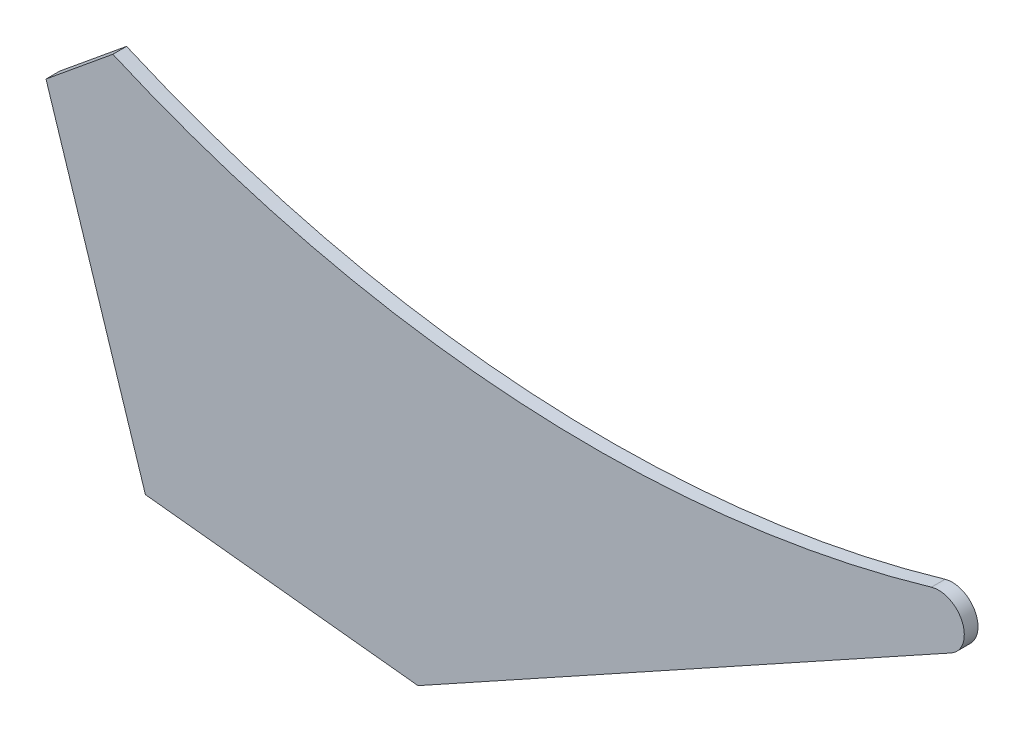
ISO-10303-21;
HEADER;
FILE_DESCRIPTION(('STEP AP214'),'2;1');
FILE_NAME('part.step','',(''),(''),'','','');
FILE_SCHEMA(('AUTOMOTIVE_DESIGN { 1 0 10303 214 1 1 1 1 }'));
ENDSEC;
DATA;
#1=APPLICATION_CONTEXT('core data for automotive mechanical design processes');
#2=APPLICATION_PROTOCOL_DEFINITION('international standard','automotive_design',2000,#1);
#3=PRODUCT_CONTEXT('',#1,'mechanical');
#4=PRODUCT('Part','Part','',(#3));
#5=PRODUCT_RELATED_PRODUCT_CATEGORY('part','',(#4));
#6=PRODUCT_DEFINITION_FORMATION('','',#4);
#7=PRODUCT_DEFINITION_CONTEXT('part definition',#1,'design');
#8=PRODUCT_DEFINITION('design','',#6,#7);
#9=PRODUCT_DEFINITION_SHAPE('','',#8);
#10=(LENGTH_UNIT() NAMED_UNIT(*) SI_UNIT(.MILLI.,.METRE.));
#11=(NAMED_UNIT(*) PLANE_ANGLE_UNIT() SI_UNIT($,.RADIAN.));
#12=(NAMED_UNIT(*) SI_UNIT($,.STERADIAN.) SOLID_ANGLE_UNIT());
#13=UNCERTAINTY_MEASURE_WITH_UNIT(LENGTH_MEASURE(1.E-05),#10,'distance_accuracy_value','');
#14=(GEOMETRIC_REPRESENTATION_CONTEXT(3) GLOBAL_UNCERTAINTY_ASSIGNED_CONTEXT((#13)) GLOBAL_UNIT_ASSIGNED_CONTEXT((#10,
#11,#12)) REPRESENTATION_CONTEXT('',''));
#15=CARTESIAN_POINT('',(0.,0.,0.));
#16=DIRECTION('',(0.,0.,1.));
#17=DIRECTION('',(1.,0.,0.));
#18=AXIS2_PLACEMENT_3D('',#15,#16,#17);
#19=CARTESIAN_POINT('',(0.,0.,8.));
#20=DIRECTION('',(-0.483969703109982,0.875084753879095,0.));
#21=DIRECTION('',(-0.875084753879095,-0.483969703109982,0.));
#22=AXIS2_PLACEMENT_3D('',#19,#20,#21);
#23=PLANE('',#22);
#24=DIRECTION('',(0.875084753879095,0.483969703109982,0.));
#25=VECTOR('',#24,1.);
#26=CARTESIAN_POINT('',(0.,0.,0.));
#27=LINE('',#26,#25);
#28=CARTESIAN_POINT('',(0.,0.,0.));
#29=VERTEX_POINT('',#28);
#30=CARTESIAN_POINT('',(311.,172.,0.));
#31=VERTEX_POINT('',#30);
#32=EDGE_CURVE('E95',#29,#31,#27,.T.);
#33=ORIENTED_EDGE('',*,*,#32,.T.);
#34=DIRECTION('',(0.,0.,-1.));
#35=VECTOR('',#34,1.);
#36=CARTESIAN_POINT('',(311.,172.,8.));
#37=LINE('',#36,#35);
#38=CARTESIAN_POINT('',(311.,172.,8.));
#39=VERTEX_POINT('',#38);
#40=EDGE_CURVE('E11',#39,#31,#37,.T.);
#41=ORIENTED_EDGE('',*,*,#40,.F.);
#42=DIRECTION('',(0.875084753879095,0.483969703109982,0.));
#43=VECTOR('',#42,1.);
#44=CARTESIAN_POINT('',(0.,0.,8.));
#45=LINE('',#44,#43);
#46=CARTESIAN_POINT('',(0.,0.,8.));
#47=VERTEX_POINT('',#46);
#48=EDGE_CURVE('E118',#47,#39,#45,.T.);
#49=ORIENTED_EDGE('',*,*,#48,.F.);
#50=DIRECTION('',(0.,0.,-1.));
#51=VECTOR('',#50,1.);
#52=CARTESIAN_POINT('',(0.,0.,8.));
#53=LINE('',#52,#51);
#54=EDGE_CURVE('E108',#47,#29,#53,.T.);
#55=ORIENTED_EDGE('',*,*,#54,.T.);
#56=EDGE_LOOP('',(#33,#41,#49,#55));
#57=FACE_BOUND('',#56,.T.);
#58=ADVANCED_FACE('F39',(#57),#23,.F.);
#59=CARTESIAN_POINT('',(303.74045445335,185.126271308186,8.));
#60=DIRECTION('',(0.,0.,-1.));
#61=DIRECTION('',(-1.,0.,0.));
#62=AXIS2_PLACEMENT_3D('',#59,#60,#61);
#63=CYLINDRICAL_SURFACE('',#62,15.);
#64=CARTESIAN_POINT('',(303.74045445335,185.126271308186,0.));
#65=DIRECTION('',(0.,0.,1.));
#66=DIRECTION('',(1.,0.,0.));
#67=AXIS2_PLACEMENT_3D('',#64,#65,#66);
#68=CIRCLE('',#67,15.);
#69=CARTESIAN_POINT('',(299.536679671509,199.525169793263,0.));
#70=VERTEX_POINT('',#69);
#71=EDGE_CURVE('E91',#31,#70,#68,.T.);
#72=ORIENTED_EDGE('',*,*,#71,.T.);
#73=DIRECTION('',(0.,0.,-1.));
#74=VECTOR('',#73,1.);
#75=CARTESIAN_POINT('',(299.536679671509,199.525169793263,8.));
#76=LINE('',#75,#74);
#77=CARTESIAN_POINT('',(299.536679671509,199.525169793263,8.));
#78=VERTEX_POINT('',#77);
#79=EDGE_CURVE('E46',#78,#70,#76,.T.);
#80=ORIENTED_EDGE('',*,*,#79,.F.);
#81=CARTESIAN_POINT('',(303.74045445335,185.126271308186,8.));
#82=DIRECTION('',(0.,0.,1.));
#83=DIRECTION('',(1.,0.,0.));
#84=AXIS2_PLACEMENT_3D('',#81,#82,#83);
#85=CIRCLE('',#84,15.);
#86=EDGE_CURVE('E104',#39,#78,#85,.T.);
#87=ORIENTED_EDGE('',*,*,#86,.F.);
#88=ORIENTED_EDGE('',*,*,#40,.T.);
#89=EDGE_LOOP('',(#72,#80,#87,#88));
#90=FACE_BOUND('',#89,.T.);
#91=ADVANCED_FACE('F103',(#90),#63,.T.);
#92=CARTESIAN_POINT('',(102.800019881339,873.393618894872,8.));
#93=DIRECTION('',(0.,0.,-1.));
#94=DIRECTION('',(-1.,0.,0.));
#95=AXIS2_PLACEMENT_3D('',#92,#93,#94);
#96=CYLINDRICAL_SURFACE('',#95,702.);
#97=CARTESIAN_POINT('',(102.800019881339,873.393618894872,0.));
#98=DIRECTION('',(0.,0.,-1.));
#99=DIRECTION('',(1.,0.,0.));
#100=AXIS2_PLACEMENT_3D('',#97,#98,#99);
#101=CIRCLE('',#100,702.);
#102=CARTESIAN_POINT('',(-178.,230.,0.));
#103=VERTEX_POINT('',#102);
#104=EDGE_CURVE('E97',#70,#103,#101,.T.);
#105=ORIENTED_EDGE('',*,*,#104,.T.);
#106=DIRECTION('',(0.,0.,-1.));
#107=VECTOR('',#106,1.);
#108=CARTESIAN_POINT('',(-178.,230.,8.));
#109=LINE('',#108,#107);
#110=CARTESIAN_POINT('',(-178.,230.,8.));
#111=VERTEX_POINT('',#110);
#112=EDGE_CURVE('E134',#111,#103,#109,.T.);
#113=ORIENTED_EDGE('',*,*,#112,.F.);
#114=CARTESIAN_POINT('',(102.800019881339,873.393618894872,8.));
#115=DIRECTION('',(0.,0.,-1.));
#116=DIRECTION('',(1.,0.,0.));
#117=AXIS2_PLACEMENT_3D('',#114,#115,#116);
#118=CIRCLE('',#117,702.);
#119=EDGE_CURVE('E121',#78,#111,#118,.T.);
#120=ORIENTED_EDGE('',*,*,#119,.F.);
#121=ORIENTED_EDGE('',*,*,#79,.T.);
#122=EDGE_LOOP('',(#105,#113,#120,#121));
#123=FACE_BOUND('',#122,.T.);
#124=ADVANCED_FACE('F138',(#123),#96,.F.);
#125=CARTESIAN_POINT('',(-217.,198.,8.));
#126=DIRECTION('',(0.634316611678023,-0.773073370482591,0.));
#127=DIRECTION('',(0.773073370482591,0.634316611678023,0.));
#128=AXIS2_PLACEMENT_3D('',#125,#126,#127);
#129=PLANE('',#128);
#130=DIRECTION('',(-0.77307337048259,-0.634316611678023,0.));
#131=VECTOR('',#130,1.);
#132=CARTESIAN_POINT('',(-217.,198.,0.));
#133=LINE('',#132,#131);
#134=CARTESIAN_POINT('',(-217.,198.,0.));
#135=VERTEX_POINT('',#134);
#136=EDGE_CURVE('E112',#103,#135,#133,.T.);
#137=ORIENTED_EDGE('',*,*,#136,.T.);
#138=DIRECTION('',(0.,0.,-1.));
#139=VECTOR('',#138,1.);
#140=CARTESIAN_POINT('',(-217.,198.,8.));
#141=LINE('',#140,#139);
#142=CARTESIAN_POINT('',(-217.,198.,8.));
#143=VERTEX_POINT('',#142);
#144=EDGE_CURVE('E131',#143,#135,#141,.T.);
#145=ORIENTED_EDGE('',*,*,#144,.F.);
#146=DIRECTION('',(-0.77307337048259,-0.634316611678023,0.));
#147=VECTOR('',#146,1.);
#148=CARTESIAN_POINT('',(-217.,198.,8.));
#149=LINE('',#148,#147);
#150=EDGE_CURVE('E123',#111,#143,#149,.T.);
#151=ORIENTED_EDGE('',*,*,#150,.F.);
#152=ORIENTED_EDGE('',*,*,#112,.T.);
#153=EDGE_LOOP('',(#137,#145,#151,#152));
#154=FACE_BOUND('',#153,.T.);
#155=ADVANCED_FACE('F144',(#154),#129,.F.);
#156=CARTESIAN_POINT('',(-159.,17.,8.));
#157=DIRECTION('',(0.952301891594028,0.305157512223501,0.));
#158=DIRECTION('',(-0.305157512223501,0.952301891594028,0.));
#159=AXIS2_PLACEMENT_3D('',#156,#157,#158);
#160=PLANE('',#159);
#161=DIRECTION('',(0.305157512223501,-0.952301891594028,0.));
#162=VECTOR('',#161,1.);
#163=CARTESIAN_POINT('',(-159.,17.,0.));
#164=LINE('',#163,#162);
#165=CARTESIAN_POINT('',(-159.,17.,0.));
#166=VERTEX_POINT('',#165);
#167=EDGE_CURVE('E114',#135,#166,#164,.T.);
#168=ORIENTED_EDGE('',*,*,#167,.T.);
#169=DIRECTION('',(0.,0.,-1.));
#170=VECTOR('',#169,1.);
#171=CARTESIAN_POINT('',(-159.,17.,8.));
#172=LINE('',#171,#170);
#173=CARTESIAN_POINT('',(-159.,17.,8.));
#174=VERTEX_POINT('',#173);
#175=EDGE_CURVE('E128',#174,#166,#172,.T.);
#176=ORIENTED_EDGE('',*,*,#175,.F.);
#177=DIRECTION('',(0.305157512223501,-0.952301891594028,0.));
#178=VECTOR('',#177,1.);
#179=CARTESIAN_POINT('',(-159.,17.,8.));
#180=LINE('',#179,#178);
#181=EDGE_CURVE('E58',#143,#174,#180,.T.);
#182=ORIENTED_EDGE('',*,*,#181,.F.);
#183=ORIENTED_EDGE('',*,*,#144,.T.);
#184=EDGE_LOOP('',(#168,#176,#182,#183));
#185=FACE_BOUND('',#184,.T.);
#186=ADVANCED_FACE('F147',(#185),#160,.F.);
#187=CARTESIAN_POINT('',(0.,0.,8.));
#188=DIRECTION('',(0.106312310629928,0.994332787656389,0.));
#189=DIRECTION('',(-0.994332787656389,0.106312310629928,0.));
#190=AXIS2_PLACEMENT_3D('',#187,#188,#189);
#191=PLANE('',#190);
#192=DIRECTION('',(0.994332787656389,-0.106312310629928,0.));
#193=VECTOR('',#192,1.);
#194=CARTESIAN_POINT('',(0.,0.,0.));
#195=LINE('',#194,#193);
#196=EDGE_CURVE('E116',#166,#29,#195,.T.);
#197=ORIENTED_EDGE('',*,*,#196,.T.);
#198=ORIENTED_EDGE('',*,*,#54,.F.);
#199=DIRECTION('',(0.994332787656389,-0.106312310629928,0.));
#200=VECTOR('',#199,1.);
#201=CARTESIAN_POINT('',(0.,0.,8.));
#202=LINE('',#201,#200);
#203=EDGE_CURVE('E53',#174,#47,#202,.T.);
#204=ORIENTED_EDGE('',*,*,#203,.F.);
#205=ORIENTED_EDGE('',*,*,#175,.T.);
#206=EDGE_LOOP('',(#197,#198,#204,#205));
#207=FACE_BOUND('',#206,.T.);
#208=ADVANCED_FACE('F149',(#207),#191,.F.);
#209=CARTESIAN_POINT('',(303.74045445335,185.126271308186,8.));
#210=DIRECTION('',(0.,0.,1.));
#211=DIRECTION('',(1.,0.,0.));
#212=AXIS2_PLACEMENT_3D('',#209,#210,#211);
#213=PLANE('',#212);
#214=ORIENTED_EDGE('',*,*,#48,.T.);
#215=ORIENTED_EDGE('',*,*,#86,.T.);
#216=ORIENTED_EDGE('',*,*,#119,.T.);
#217=ORIENTED_EDGE('',*,*,#150,.T.);
#218=ORIENTED_EDGE('',*,*,#181,.T.);
#219=ORIENTED_EDGE('',*,*,#203,.T.);
#220=EDGE_LOOP('',(#214,#215,#216,#217,#218,#219));
#221=FACE_BOUND('',#220,.T.);
#222=ADVANCED_FACE('F141',(#221),#213,.T.);
#223=CARTESIAN_POINT('',(303.74045445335,185.126271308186,0.));
#224=DIRECTION('',(0.,0.,1.));
#225=DIRECTION('',(1.,0.,0.));
#226=AXIS2_PLACEMENT_3D('',#223,#224,#225);
#227=PLANE('',#226);
#228=ORIENTED_EDGE('',*,*,#32,.F.);
#229=ORIENTED_EDGE('',*,*,#196,.F.);
#230=ORIENTED_EDGE('',*,*,#167,.F.);
#231=ORIENTED_EDGE('',*,*,#136,.F.);
#232=ORIENTED_EDGE('',*,*,#104,.F.);
#233=ORIENTED_EDGE('',*,*,#71,.F.);
#234=EDGE_LOOP('',(#228,#229,#230,#231,#232,#233));
#235=FACE_BOUND('',#234,.T.);
#236=ADVANCED_FACE('F92',(#235),#227,.F.);
#237=CLOSED_SHELL('',(#58,#91,#124,#155,#186,#208,#222,#236));
#238=MANIFOLD_SOLID_BREP('B2',#237);
#239=ADVANCED_BREP_SHAPE_REPRESENTATION('',(#18,#238),#14);
#240=SHAPE_DEFINITION_REPRESENTATION(#9,#239);
ENDSEC;
END-ISO-10303-21;
